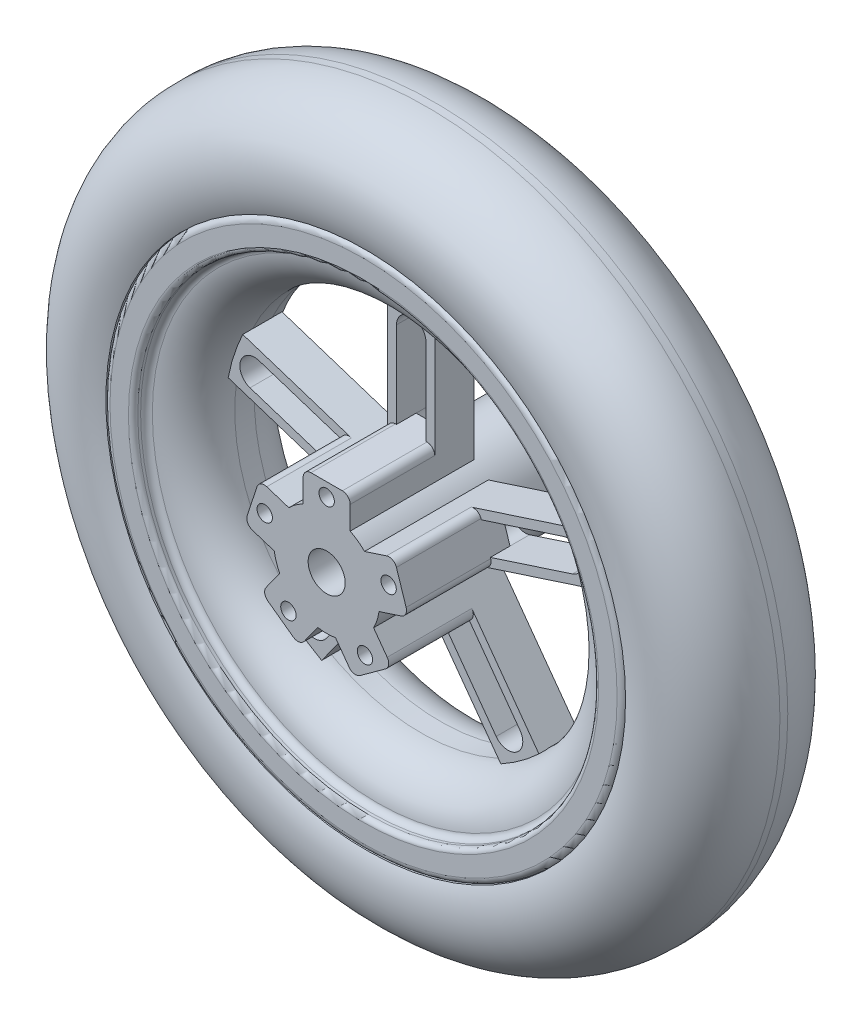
from build123d import *

# Parameters (mm, degrees)
FILLET1_R                = 2.032
FILLET2_R                = 2.032
FILLET3_R                = 1.524
BOSS_EXTRUDE1_DEPTH      = 33.7312
BOSS_EXTRUDE1_DEPTH_BACK = 32.9692
SKETCH7_R                = 17.145
SKETCH7_R_2              = 6.000000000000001
BOSS_EXTRUDE2_DEPTH      = 6.35
BOSS_EXTRUDE3_REACH      = 167.127
SKETCH11_R               = 2.4892
FILLET4_R                = 2.54


with BuildPart() as part:
    # Sketch4 → Revolve1 (revolve)
    with BuildSketch(Plane(origin=(0, 0, 0), x_dir=(0, 0, -1), z_dir=(1, 0, 0)), mode=Mode.PRIVATE) as revolve1_sk:
        with BuildLine():
            Line((0, 60.325), (3.174999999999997, 60.325))
            ThreePointArc((3.174999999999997, 60.325), (13.277788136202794, 64.50971186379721), (17.462499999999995, 74.6125))
            Line((17.462499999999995, 74.6125), (21.7932, 74.6125))
            Line((21.7932, 74.6125), (21.7932, 84.1375))
            Line((21.7932, 84.1375), (0, 84.1375))
            Line((0, 84.1375), (-21.7932, 84.1375))
            Line((-21.7932, 84.1375), (-21.7932, 74.6125))
            Line((-21.7932, 74.6125), (-17.462499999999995, 74.6125))
            ThreePointArc((-17.462499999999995, 74.6125), (-13.277788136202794, 64.50971186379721), (-3.174999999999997, 60.325))
            Line((-3.174999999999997, 60.325), (0, 60.325))
        make_face()
    revolve(revolve1_sk.sketch.rotate(Axis((0, 0, 0), (0, 0, -1)), 90), axis=Axis((0, 0, 0), (0, 0, -1)))

    # Fillet1
    fillet1_edges = [part.edges().sort_by_distance(p)[0] for p in [
        (-84.1375, -1.965e-14, 21.7932),
        (-84.1375, -1.965e-14, -21.7932),
    ]]
    fillet(fillet1_edges, radius=FILLET1_R)

    # Fillet2
    fillet2_edges = [part.edges().sort_by_distance(p)[0] for p in [
        (-74.6125, -1.742e-14, -17.46249999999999),
        (-74.6125, -1.742e-14, 17.46249999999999),
    ]]
    fillet(fillet2_edges, radius=FILLET2_R)

    # Fillet3
    fillet3_edges = [part.edges().sort_by_distance(p)[0] for p in [
        (-74.6125, -1.742e-14, 21.7932),
        (-74.6125, -1.742e-14, -21.7932),
    ]]
    fillet(fillet3_edges, radius=FILLET3_R)


with BuildPart() as body_2:
    # Sketch5 → Revolve2 (revolve)
    with BuildSketch(Plane(origin=(0, 0, 0), x_dir=(0, 0, -1), z_dir=(1, 0, 0)), mode=Mode.PRIVATE) as revolve2_sk:
        with BuildLine():
            Line((0, 84.1375), (21.085154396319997, 84.1375))
            ThreePointArc((21.085154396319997, 84.1375), (19.31450574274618, 104.56427823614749), (1.270000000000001, 114.30000000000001))
            Line((1.270000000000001, 114.30000000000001), (0, 114.30000000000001))
            Line((0, 114.30000000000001), (-1.270000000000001, 114.30000000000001))
            ThreePointArc((-1.270000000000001, 114.30000000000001), (-19.314505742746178, 104.5642782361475), (-21.085154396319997, 84.1375))
            Line((-21.085154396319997, 84.1375), (0, 84.1375))
        make_face()
    revolve(revolve2_sk.sketch.rotate(Axis((0, 0, 0), (0, 0, -1)), 90), axis=Axis((0, 0, 0), (0, 0, -1)))


with BuildPart() as body_3:
    # Sketch7 → Boss-Extrude1 (new, two sides: drawn at the far end of the back side and taken through both)
    with BuildSketch(Plane.XY.offset(-BOSS_EXTRUDE1_DEPTH_BACK)):
        Circle(SKETCH7_R)
        Circle(SKETCH7_R_2, mode=Mode.SUBTRACT)
    extrude(amount=BOSS_EXTRUDE1_DEPTH + BOSS_EXTRUDE1_DEPTH_BACK)

    # Sketch10 → Boss-Extrude2 (add, symmetric)
    # profile 1 of 5: a face of its own
    with BuildSketch(Plane.XY):
        with BuildLine():
            Line((-12.252188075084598, 11.993119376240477), (-54.5582259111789, 25.739184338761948))
            ThreePointArc((-54.5582259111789, 25.739184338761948), (-57.37248434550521, 18.641450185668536), (-59.267644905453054, 11.245083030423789))
            Line((-59.267644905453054, 11.245083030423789), (-16.96160706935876, -2.5009819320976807))
            ThreePointArc((-16.96160706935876, -2.5009819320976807), (-16.30586397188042, 5.298096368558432), (-12.252188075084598, 11.993119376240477))
        make_face()
        with BuildLine():
            Line((-22.685142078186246, 12.378438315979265), (-49.257661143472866, 21.012373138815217))
            ThreePointArc((-49.257661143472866, 21.012373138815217), (-55.258761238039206, 17.95465991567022), (-52.20104801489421, 11.953559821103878))
            Line((-52.20104801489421, 11.953559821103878), (-25.628528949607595, 3.3196249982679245))
            ThreePointArc((-25.628528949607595, 3.3196249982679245), (-19.62742885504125, 6.37733822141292), (-22.685142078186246, 12.378438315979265))
        make_face(mode=Mode.SUBTRACT)
    # profile 2 of 5: a face of its own
    with BuildSketch(Plane.XY):
        with BuildLine():
            Line((-7.619999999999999, 59.84180165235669), (-7.619999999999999, 15.358601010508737))
            ThreePointArc((-7.619999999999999, 15.358601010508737), (1.05e-15, 17.145), (7.619999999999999, 15.358601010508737))
            Line((7.619999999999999, 15.358601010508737), (7.619999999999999, 59.84180165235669))
            ThreePointArc((7.619999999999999, 59.84180165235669), (3.69e-15, 60.325), (-7.619999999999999, 59.84180165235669))
        make_face()
        with BuildLine():
            Line((4.7625, 25.4), (4.7625, 53.339999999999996))
            ThreePointArc((4.7625, 53.339999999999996), (2.9e-16, 58.1025), (-4.7625, 53.339999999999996))
            Line((-4.7625, 53.339999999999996), (-4.7625, 25.4))
            ThreePointArc((-4.7625, 25.4), (-8.7e-16, 20.6375), (4.7625, 25.4))
        make_face(mode=Mode.SUBTRACT)
    # profile 3 of 5: a face of its own
    with BuildSketch(Plane.XY):
        with BuildLine():
            Line((12.252188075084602, 11.993119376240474), (54.5582259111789, 25.73918433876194))
            ThreePointArc((54.5582259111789, 25.73918433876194), (57.37248434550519, 18.641450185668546), (59.267644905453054, 11.245083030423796))
            Line((59.267644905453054, 11.245083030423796), (16.96160706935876, -2.5009819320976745))
            ThreePointArc((16.96160706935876, -2.5009819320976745), (16.305863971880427, 5.298096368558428), (12.252188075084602, 11.993119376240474))
        make_face()
        with BuildLine():
            Line((25.62852894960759, 3.3196249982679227), (52.20104801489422, 11.953559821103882))
            ThreePointArc((52.20104801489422, 11.953559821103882), (55.25876123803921, 17.95465991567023), (49.257661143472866, 21.012373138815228))
            Line((49.257661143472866, 21.012373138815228), (22.685142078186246, 12.378438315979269))
            ThreePointArc((22.685142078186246, 12.378438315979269), (19.627428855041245, 6.377338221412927), (25.62852894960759, 3.3196249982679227))
        make_face(mode=Mode.SUBTRACT)
    # profile 4 of 5: a face of its own
    with BuildSketch(Plane.XY):
        with BuildLine():
            Line((15.192268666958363, -7.9464456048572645), (41.33883797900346, -43.93411088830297))
            ThreePointArc((41.33883797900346, -43.93411088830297), (35.458145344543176, -48.8039501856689), (29.00941898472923, -52.89195813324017))
            Line((29.00941898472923, -52.89195813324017), (2.862849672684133, -16.904292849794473))
            ThreePointArc((2.862849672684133, -16.904292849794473), (10.07757815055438, -13.870596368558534), (15.192268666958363, -7.9464456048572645))
        make_face()
        with BuildLine():
            Line((27.499521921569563, -45.952293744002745), (11.076801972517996, -23.34835892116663))
            ThreePointArc((11.076801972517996, -23.34835892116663), (12.130418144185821, -16.696088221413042), (18.782688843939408, -17.749704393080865))
            Line((18.782688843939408, -17.749704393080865), (35.20540879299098, -40.35363921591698))
            ThreePointArc((35.20540879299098, -40.35363921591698), (34.15179262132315, -47.00590991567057), (27.499521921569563, -45.952293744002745))
        make_face(mode=Mode.SUBTRACT)
    # profile 5 of 5: a face of its own
    with BuildSketch(Plane.XY):
        with BuildLine():
            Line((-2.862849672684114, -16.904292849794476), (-29.009418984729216, -52.8919581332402))
            ThreePointArc((-29.009418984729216, -52.8919581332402), (-35.45814534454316, -48.803950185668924), (-41.33883797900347, -43.934110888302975))
            Line((-41.33883797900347, -43.934110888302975), (-15.192268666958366, -7.946445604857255))
            ThreePointArc((-15.192268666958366, -7.946445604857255), (-10.077578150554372, -13.870596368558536), (-2.862849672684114, -16.904292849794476))
        make_face()
        with BuildLine():
            Line((-27.499521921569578, -45.95229374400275), (-11.076801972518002, -23.348358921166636))
            ThreePointArc((-11.076801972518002, -23.348358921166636), (-12.130418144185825, -16.69608822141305), (-18.782688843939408, -17.74970439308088))
            Line((-18.782688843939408, -17.74970439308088), (-35.205408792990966, -40.353639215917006))
            ThreePointArc((-35.205408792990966, -40.353639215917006), (-34.151792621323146, -47.00590991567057), (-27.499521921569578, -45.95229374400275))
        make_face(mode=Mode.SUBTRACT)
    extrude(amount=BOSS_EXTRUDE2_DEPTH, both=True)

    # Boss-Extrude3: up to this face of the body (flat: up to its plane)
    boss_extrude3_end = Plane(body_3.part.faces().sort_by_distance((-16.660066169, 0, 33.7312))[0])
    # Sketch11 → Boss-Extrude3 (add, up to the picked face)
    with BuildSketch(Plane.XY, mode=Mode.PRIVATE) as boss_extrude3_sk1:
        with BuildLine():
            Line((0, 25.4), (7.619999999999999, 25.4))
            Line((7.619999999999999, 25.4), (7.619999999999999, 15.358601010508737))
            ThreePointArc((7.619999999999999, 15.358601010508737), (1.05e-15, 17.145), (-7.619999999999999, 15.358601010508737))
            Line((-7.619999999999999, 15.358601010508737), (-7.619999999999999, 25.4))
            Line((-7.619999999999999, 25.4), (0, 25.4))
        make_face()
        with Locations(Location((0, 21.082, 0), (0, 0, 174.233609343))):
            Circle(SKETCH11_R, mode=Mode.SUBTRACT)
    boss_extrude3_tool1 = split(extrude(boss_extrude3_sk1.sketch, amount=BOSS_EXTRUDE3_REACH, mode=Mode.PRIVATE), bisect_by=boss_extrude3_end, keep=Keep.BOTH, mode=Mode.PRIVATE)
    # Sketch11 → Boss-Extrude3 (add, up to the picked face)
    with BuildSketch(Plane.XY, mode=Mode.PRIVATE) as boss_extrude3_sk2:
        with BuildLine():
            Line((24.15683551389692, 7.8490316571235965), (21.802126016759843, 15.096082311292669))
            Line((21.802126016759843, 15.096082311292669), (12.252188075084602, 11.993119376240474))
            ThreePointArc((12.252188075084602, 11.993119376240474), (16.305863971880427, 5.298096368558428), (16.96160706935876, -2.5009819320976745))
            Line((16.96160706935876, -2.5009819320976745), (26.511545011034, 0.6019810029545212))
            Line((26.511545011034, 0.6019810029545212), (24.15683551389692, 7.8490316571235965))
        make_face()
        with Locations(Location((20.050173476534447, 6.514696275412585, 0), (0, 0, 102.233609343))):
            Circle(SKETCH11_R, mode=Mode.SUBTRACT)
    boss_extrude3_tool2 = split(extrude(boss_extrude3_sk2.sketch, amount=BOSS_EXTRUDE3_REACH, mode=Mode.PRIVATE), bisect_by=boss_extrude3_end, keep=Keep.BOTH, mode=Mode.PRIVATE)
    # Sketch11 → Boss-Extrude3 (add, up to the picked face)
    with BuildSketch(Plane.XY, mode=Mode.PRIVATE) as boss_extrude3_sk3:
        with BuildLine():
            Line((14.929745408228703, -20.549031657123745), (8.765035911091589, -25.02795527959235))
            Line((8.765035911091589, -25.02795527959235), (2.862849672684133, -16.904292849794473))
            ThreePointArc((2.862849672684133, -16.904292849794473), (10.07757815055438, -13.870596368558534), (15.192268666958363, -7.9464456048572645))
            Line((15.192268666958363, -7.9464456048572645), (21.094454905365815, -16.070108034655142))
            Line((21.094454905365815, -16.070108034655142), (14.929745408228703, -20.549031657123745))
        make_face()
        with Locations(Location((12.391688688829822, -17.055696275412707, 0), (0, 0, 221.766390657))):
            Circle(SKETCH11_R, mode=Mode.SUBTRACT)
    boss_extrude3_tool3 = split(extrude(boss_extrude3_sk3.sketch, amount=BOSS_EXTRUDE3_REACH, mode=Mode.PRIVATE), bisect_by=boss_extrude3_end, keep=Keep.BOTH, mode=Mode.PRIVATE)
    # Sketch11 → Boss-Extrude3 (add, up to the picked face)
    with BuildSketch(Plane.XY, mode=Mode.PRIVATE) as boss_extrude3_sk4:
        with BuildLine():
            Line((-14.929745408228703, -20.549031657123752), (-8.765035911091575, -25.02795527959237))
            Line((-8.765035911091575, -25.02795527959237), (-2.862849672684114, -16.904292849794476))
            ThreePointArc((-2.862849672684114, -16.904292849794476), (-10.077578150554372, -13.870596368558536), (-15.192268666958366, -7.946445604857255))
            Line((-15.192268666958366, -7.946445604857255), (-21.094454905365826, -16.070108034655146))
            Line((-21.094454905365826, -16.070108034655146), (-14.929745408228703, -20.549031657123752))
        make_face()
        with Locations(Location((-12.391688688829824, -17.05569627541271, 0), (0, 0, 149.766390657))):
            Circle(SKETCH11_R, mode=Mode.SUBTRACT)
    boss_extrude3_tool4 = split(extrude(boss_extrude3_sk4.sketch, amount=BOSS_EXTRUDE3_REACH, mode=Mode.PRIVATE), bisect_by=boss_extrude3_end, keep=Keep.BOTH, mode=Mode.PRIVATE)
    # Sketch11 → Boss-Extrude3 (add, up to the picked face)
    with BuildSketch(Plane.XY, mode=Mode.PRIVATE) as boss_extrude3_sk5:
        with BuildLine():
            Line((-24.15683551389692, 7.849031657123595), (-26.511545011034, 0.6019810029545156))
            Line((-26.511545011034, 0.6019810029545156), (-16.96160706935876, -2.5009819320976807))
            ThreePointArc((-16.96160706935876, -2.5009819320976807), (-16.30586397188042, 5.298096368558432), (-12.252188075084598, 11.993119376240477))
            Line((-12.252188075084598, 11.993119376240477), (-21.802126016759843, 15.096082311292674))
            Line((-21.802126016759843, 15.096082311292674), (-24.15683551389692, 7.849031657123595))
        make_face()
        with Locations(Location((-20.050173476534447, 6.514696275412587, 0), (0, 0, 246.233609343))):
            Circle(SKETCH11_R, mode=Mode.SUBTRACT)
    boss_extrude3_tool5 = split(extrude(boss_extrude3_sk5.sketch, amount=BOSS_EXTRUDE3_REACH, mode=Mode.PRIVATE), bisect_by=boss_extrude3_end, keep=Keep.BOTH, mode=Mode.PRIVATE)
    add(boss_extrude3_tool1.solids().sort_by(Axis((-7.437493, 20.379301, 0), (0, 0, 1)))[0])
    add(boss_extrude3_tool2.solids().sort_by(Axis((21.666586, -0.734094, 0), (0, 0, 1)))[0])
    add(boss_extrude3_tool3.solids().sort_by(Axis((17.941242, -12.155125, 0), (0, 0, 1)))[0])
    add(boss_extrude3_tool4.solids().sort_by(Axis((-17.941242, -12.155125, 0), (0, 0, 1)))[0])
    add(boss_extrude3_tool5.solids().sort_by(Axis((-17.097147, 13.329194, 0), (0, 0, 1)))[0])

    # Fillet4
    fillet4_edges = [body_3.edges().sort_by_distance(p)[0] for p in [
        (7.619999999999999, 25.4, 20.040599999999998),
        (-7.619999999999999, 25.4, 20.040599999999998),
        (21.802126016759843, 15.096082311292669, 20.0406),
        (26.511545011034, 0.6019810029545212, 20.040599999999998),
        (8.765035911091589, -25.02795527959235, 20.0406),
        (21.094454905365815, -16.070108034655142, 20.0406),
        (-8.765035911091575, -25.02795527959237, 20.040599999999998),
        (-21.094454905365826, -16.070108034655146, 20.040599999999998),
        (-26.511545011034, 0.6019810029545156, 20.040599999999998),
        (-21.802126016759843, 15.096082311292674, 20.0406),
    ]]
    fillet(fillet4_edges, radius=FILLET4_R)


solid = Compound([part.part, body_2.part, body_3.part])
